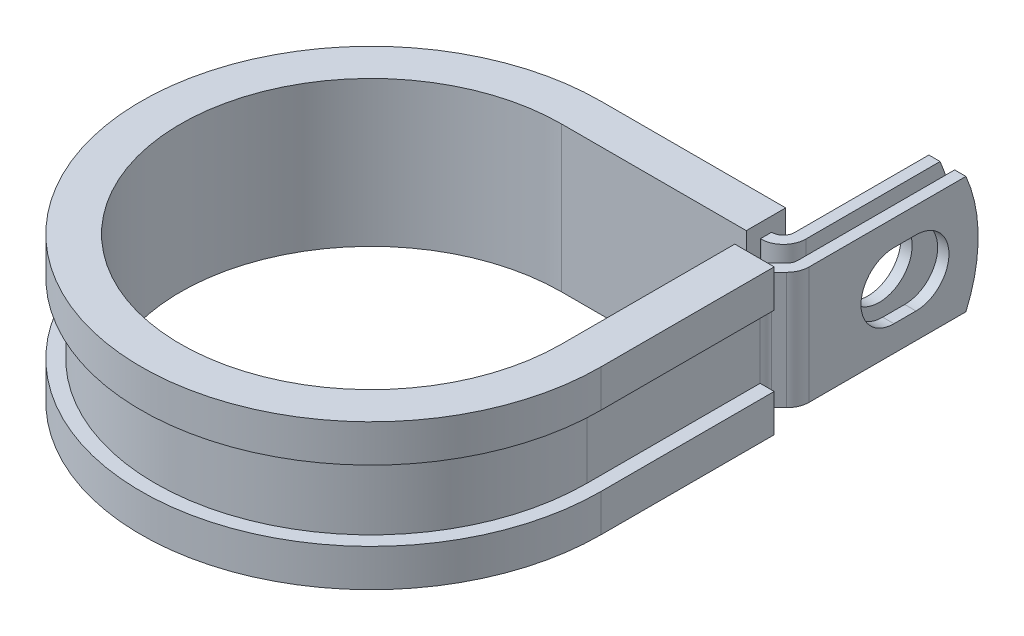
from build123d import *

# Parameters (mm, degrees)
EXTRUDE_THIN1_DEPTH = 6.35
SKETCH2_R           = 3.5687
CUT_EXTRUDE1_DEPTH  = 1.2192
CUT_EXTRUDE2_DEPTH  = 1.2192
CUT_EXTRUDE3_DEPTH  = 61.586697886


with BuildPart() as part:
    # Sketch1 → Extrude-Thin1 (new, symmetric)
    with BuildSketch(Plane(origin=(0, 0, 0), x_dir=(1, 0, 0), z_dir=(0, 1, 0))):
        with BuildLine():
            Line((24.0589698, 40.4622), (24.0589698, 22.1615))
            ThreePointArc((24.0589698, 22.1615), (23.966163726, 21.694932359), (23.701874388, 21.299395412))
            Line((23.701874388, 21.299395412), (22.875690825, 20.473211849))
            ThreePointArc((22.875690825, 20.473211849), (22.347112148, 19.682137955), (22.1615, 18.749002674))
            Line((22.1615, 18.749002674), (22.1615, 0))
            ThreePointArc((22.1615, 0), (-15.670546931, -15.670546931), (0, 22.1615))
            Line((0, 22.1615), (20.0457698, 22.1615))
            ThreePointArc((20.0457698, 22.1615), (21.769978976, 22.875690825), (22.4841698, 24.5999))
            Line((22.4841698, 24.5999), (22.4841698, 40.4622))
            Line((22.4841698, 40.4622), (21.2649698, 40.4622))
            Line((21.2649698, 40.4622), (21.2649698, 24.5999))
            ThreePointArc((21.2649698, 24.5999), (20.907874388, 23.737795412), (20.0457698, 23.3807))
            Line((20.0457698, 23.3807), (0, 23.3807))
            ThreePointArc((0, 23.3807), (-16.532651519, -16.532651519), (23.3807, 0))
            Line((23.3807, 0), (23.3807, 18.749002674))
            ThreePointArc((23.3807, 18.749002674), (23.473506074, 19.215570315), (23.737795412, 19.611107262))
            Line((23.737795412, 19.611107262), (24.563978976, 20.437290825))
            ThreePointArc((24.563978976, 20.437290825), (25.092557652, 21.228364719), (25.2781698, 22.1615))
            Line((25.2781698, 22.1615), (25.2781698, 40.4622))
            Line((25.2781698, 40.4622), (24.0589698, 40.4622))
        make_face()
    extrude(amount=EXTRUDE_THIN1_DEPTH, both=True)

    # Sketch2 → Cut-Extrude1 (cut)
    with BuildSketch(Plane.ZY.offset(-21.2649698)):
        with Locations((-32.5374, 0)):
            Circle(SKETCH2_R)
    extrude(amount=-CUT_EXTRUDE1_DEPTH, mode=Mode.SUBTRACT)

    # Sketch3 → Cut-Extrude2 (cut)
    with BuildSketch(Plane(origin=(25.2781698, 0, 0), x_dir=(0, 0, -1), z_dir=(1, 0, 0))):
        with BuildLine():
            Line((31.3436, 3.5687), (33.7312, 3.5687))
            ThreePointArc((33.7312, 3.5687), (37.2999, 0), (33.7312, -3.5687))
            Line((33.7312, -3.5687), (31.3436, -3.5687))
            ThreePointArc((31.3436, -3.5687), (27.7749, 0), (31.3436, 3.5687))
        make_face()
    extrude(amount=-CUT_EXTRUDE2_DEPTH, mode=Mode.SUBTRACT)

    # Sketch4 → Cut-Extrude3 (cut, through all)
    with BuildSketch(Plane.ZY.offset(-21.2649698)):
        with BuildLine():
            Line((-39.136877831, 6.35), (-40.4622, 6.35))
            Line((-40.4622, 6.35), (-40.4622, -1.15e-07))
            ThreePointArc((-40.4622, -1.15e-07), (-40.12733773, 3.243415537), (-39.136877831, 6.35))
        make_face()
        with BuildLine():
            ThreePointArc((-39.136877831, -6.35), (-40.127337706, -3.24341565), (-40.4622, -1.15e-07))
            Line((-40.4622, -1.15e-07), (-40.4622, -6.35))
            Line((-40.4622, -6.35), (-39.136877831, -6.35))
        make_face()
    extrude(amount=-CUT_EXTRUDE3_DEPTH, mode=Mode.SUBTRACT)

    # Sweep1: sweep along a path in Sketch6
    with BuildLine(Plane(origin=(0, 6.35, 0), x_dir=(1, 0, 0), z_dir=(0, 1, 0))) as sweep1_path:
        Line((20.6375, 18.749002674), (20.6375, 0))
        ThreePointArc((20.6375, 0), (-14.592916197, -14.592916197), (0, 20.6375))
        Line((0, 20.6375), (19.9949698, 20.6375))
    # Sketch5 → Sweep1 (sweep)
    with BuildSketch(Plane(origin=(0, 0, -18.749002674), x_dir=(-1, 0, 0), z_dir=(0, 0, -1))):
        Polygon((-23.3807, 6.35), (-22.1615, 6.35), (-22.1615, -6.35), (-23.3807, -6.35), (-23.3807, -3.81), (-24.9047, -3.81), (-24.9047, -7.874), (-20.6375, -7.874), (-20.6375, 7.874), (-24.9047, 7.874), (-24.9047, 3.81), (-23.3807, 3.81), align=None)
    sweep(path=sweep1_path.line)


solid = part.part
